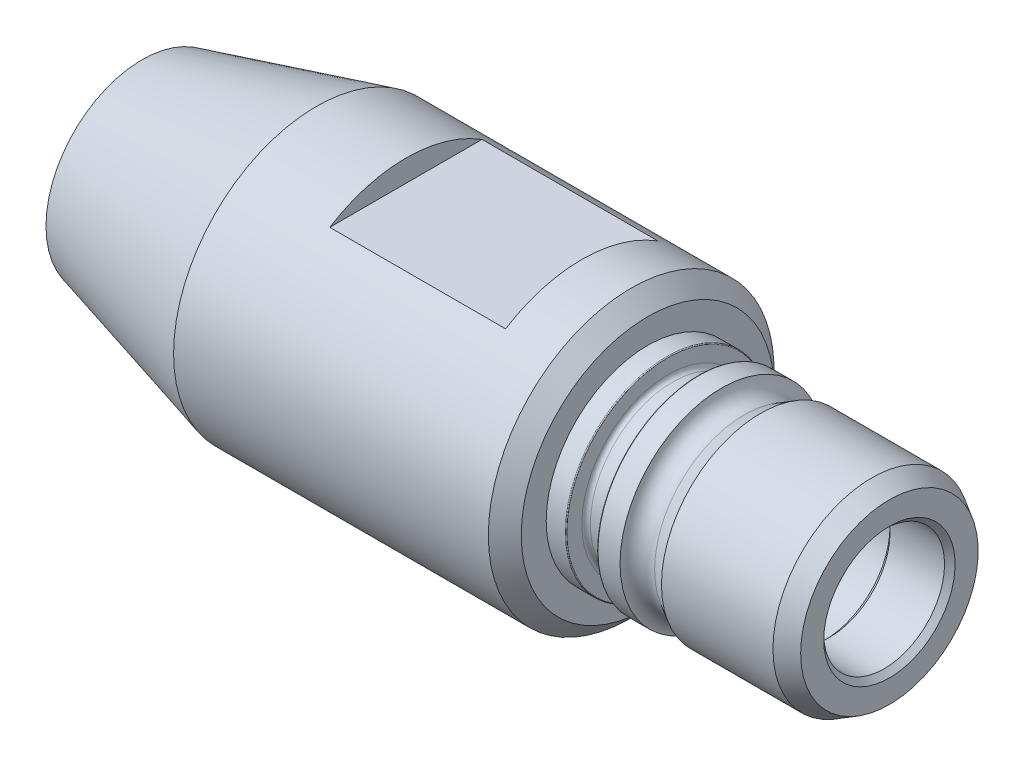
ISO-10303-21;
HEADER;
FILE_DESCRIPTION(('STEP AP214'),'2;1');
FILE_NAME('part.step','',(''),(''),'','','');
FILE_SCHEMA(('AUTOMOTIVE_DESIGN { 1 0 10303 214 1 1 1 1 }'));
ENDSEC;
DATA;
#1=APPLICATION_CONTEXT('core data for automotive mechanical design processes');
#2=APPLICATION_PROTOCOL_DEFINITION('international standard','automotive_design',2000,#1);
#3=PRODUCT_CONTEXT('',#1,'mechanical');
#4=PRODUCT('Part','Part','',(#3));
#5=PRODUCT_RELATED_PRODUCT_CATEGORY('part','',(#4));
#6=PRODUCT_DEFINITION_FORMATION('','',#4);
#7=PRODUCT_DEFINITION_CONTEXT('part definition',#1,'design');
#8=PRODUCT_DEFINITION('design','',#6,#7);
#9=PRODUCT_DEFINITION_SHAPE('','',#8);
#10=(LENGTH_UNIT() NAMED_UNIT(*) SI_UNIT(.MILLI.,.METRE.));
#11=(NAMED_UNIT(*) PLANE_ANGLE_UNIT() SI_UNIT($,.RADIAN.));
#12=(NAMED_UNIT(*) SI_UNIT($,.STERADIAN.) SOLID_ANGLE_UNIT());
#13=UNCERTAINTY_MEASURE_WITH_UNIT(LENGTH_MEASURE(1.E-05),#10,'distance_accuracy_value','');
#14=(GEOMETRIC_REPRESENTATION_CONTEXT(3) GLOBAL_UNCERTAINTY_ASSIGNED_CONTEXT((#13)) GLOBAL_UNIT_ASSIGNED_CONTEXT((#10,
#11,#12)) REPRESENTATION_CONTEXT('',''));
#15=CARTESIAN_POINT('',(0.,0.,0.));
#16=DIRECTION('',(0.,0.,1.));
#17=DIRECTION('',(1.,0.,0.));
#18=AXIS2_PLACEMENT_3D('',#15,#16,#17);
#19=CARTESIAN_POINT('',(0.,0.,0.));
#20=DIRECTION('',(1.,0.,0.));
#21=DIRECTION('',(0.,0.,-1.));
#22=AXIS2_PLACEMENT_3D('',#19,#20,#21);
#23=PLANE('',#22);
#24=CARTESIAN_POINT('',(0.,0.,0.));
#25=DIRECTION('',(-1.,0.,0.));
#26=DIRECTION('',(0.,0.,1.));
#27=AXIS2_PLACEMENT_3D('',#24,#25,#26);
#28=CIRCLE('',#27,13.890625);
#29=CARTESIAN_POINT('',(0.,0.,13.890625));
#30=VERTEX_POINT('',#29);
#31=EDGE_CURVE('E274',#30,#30,#28,.T.);
#32=ORIENTED_EDGE('',*,*,#31,.T.);
#33=EDGE_LOOP('',(#32));
#34=FACE_BOUND('',#33,.T.);
#35=CARTESIAN_POINT('',(0.,0.,0.));
#36=DIRECTION('',(-1.,0.,0.));
#37=DIRECTION('',(0.,0.,1.));
#38=AXIS2_PLACEMENT_3D('',#35,#36,#37);
#39=CIRCLE('',#38,8.7249);
#40=CARTESIAN_POINT('',(0.,0.,8.7249));
#41=VERTEX_POINT('',#40);
#42=EDGE_CURVE('E261',#41,#41,#39,.T.);
#43=ORIENTED_EDGE('',*,*,#42,.F.);
#44=EDGE_LOOP('',(#43));
#45=FACE_BOUND('',#44,.T.);
#46=ADVANCED_FACE('F35',(#34,#45),#23,.F.);
#47=CARTESIAN_POINT('',(0.,0.,0.));
#48=DIRECTION('',(-1.,0.,0.));
#49=DIRECTION('',(0.,0.,1.));
#50=AXIS2_PLACEMENT_3D('',#47,#48,#49);
#51=CYLINDRICAL_SURFACE('',#50,14.2875);
#52=CARTESIAN_POINT('',(89.3067904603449,0.,0.));
#53=DIRECTION('',(-1.,0.,0.));
#54=DIRECTION('',(0.,0.,1.));
#55=AXIS2_PLACEMENT_3D('',#52,#53,#54);
#56=CIRCLE('',#55,14.2875);
#57=CARTESIAN_POINT('',(89.3067904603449,0.,14.2875));
#58=VERTEX_POINT('',#57);
#59=EDGE_CURVE('E312',#58,#58,#56,.T.);
#60=ORIENTED_EDGE('',*,*,#59,.F.);
#61=EDGE_LOOP('',(#60));
#62=FACE_BOUND('',#61,.T.);
#63=CARTESIAN_POINT('',(105.41,0.,0.));
#64=DIRECTION('',(-1.,0.,0.));
#65=DIRECTION('',(0.,0.,1.));
#66=AXIS2_PLACEMENT_3D('',#63,#64,#65);
#67=CIRCLE('',#66,14.2875);
#68=CARTESIAN_POINT('',(105.41,0.,14.2875));
#69=VERTEX_POINT('',#68);
#70=EDGE_CURVE('E264',#69,#69,#67,.T.);
#71=ORIENTED_EDGE('',*,*,#70,.T.);
#72=EDGE_LOOP('',(#71));
#73=FACE_BOUND('',#72,.T.);
#74=ADVANCED_FACE('F111',(#62,#73),#51,.T.);
#75=CARTESIAN_POINT('',(73.025,14.6558,0.));
#76=DIRECTION('',(-1.,0.,0.));
#77=DIRECTION('',(0.,0.,1.));
#78=AXIS2_PLACEMENT_3D('',#75,#76,#77);
#79=PLANE('',#78);
#80=CARTESIAN_POINT('',(73.025,0.,0.));
#81=DIRECTION('',(-1.,0.,0.));
#82=DIRECTION('',(0.,0.,1.));
#83=AXIS2_PLACEMENT_3D('',#80,#81,#82);
#84=CIRCLE('',#83,14.6558);
#85=CARTESIAN_POINT('',(73.025,0.,14.6558));
#86=VERTEX_POINT('',#85);
#87=EDGE_CURVE('E279',#86,#86,#84,.T.);
#88=ORIENTED_EDGE('',*,*,#87,.T.);
#89=EDGE_LOOP('',(#88));
#90=FACE_BOUND('',#89,.T.);
#91=CARTESIAN_POINT('',(73.025,0.,0.));
#92=DIRECTION('',(-1.,0.,0.));
#93=DIRECTION('',(0.,0.,1.));
#94=AXIS2_PLACEMENT_3D('',#91,#92,#93);
#95=CIRCLE('',#94,18.25625);
#96=CARTESIAN_POINT('',(73.025,0.,18.25625));
#97=VERTEX_POINT('',#96);
#98=EDGE_CURVE('E270',#97,#97,#95,.T.);
#99=ORIENTED_EDGE('',*,*,#98,.F.);
#100=EDGE_LOOP('',(#99));
#101=FACE_BOUND('',#100,.T.);
#102=ADVANCED_FACE('F117',(#90,#101),#79,.F.);
#103=CARTESIAN_POINT('',(89.3067904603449,0.,0.));
#104=DIRECTION('',(1.,0.,0.));
#105=DIRECTION('',(0.,0.,-1.));
#106=AXIS2_PLACEMENT_3D('',#103,#104,#105);
#107=CONICAL_SURFACE('',#106,14.2875,0.523598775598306);
#108=CARTESIAN_POINT('',(86.96198,0.,0.));
#109=DIRECTION('',(-1.,0.,0.));
#110=DIRECTION('',(0.,0.,1.));
#111=AXIS2_PLACEMENT_3D('',#108,#109,#110);
#112=CIRCLE('',#111,12.9337230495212);
#113=CARTESIAN_POINT('',(86.96198,0.,12.9337230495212));
#114=VERTEX_POINT('',#113);
#115=EDGE_CURVE('E309',#114,#114,#112,.T.);
#116=ORIENTED_EDGE('',*,*,#115,.F.);
#117=EDGE_LOOP('',(#116));
#118=FACE_BOUND('',#117,.T.);
#119=ORIENTED_EDGE('',*,*,#59,.T.);
#120=EDGE_LOOP('',(#119));
#121=FACE_BOUND('',#120,.T.);
#122=ADVANCED_FACE('F136',(#118,#121),#107,.T.);
#123=CARTESIAN_POINT('',(85.9550265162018,0.,0.));
#124=DIRECTION('',(-1.,0.,0.));
#125=DIRECTION('',(0.,0.,1.));
#126=AXIS2_PLACEMENT_3D('',#123,#124,#125);
#127=TOROIDAL_SURFACE('',#126,14.986,2.286);
#128=CARTESIAN_POINT('',(83.693,0.,0.));
#129=DIRECTION('',(-1.,0.,0.));
#130=DIRECTION('',(0.,0.,1.));
#131=AXIS2_PLACEMENT_3D('',#128,#129,#130);
#132=CIRCLE('',#131,14.6558);
#133=CARTESIAN_POINT('',(83.693,0.,14.6558));
#134=VERTEX_POINT('',#133);
#135=EDGE_CURVE('E306',#134,#134,#132,.T.);
#136=ORIENTED_EDGE('',*,*,#135,.F.);
#137=EDGE_LOOP('',(#136));
#138=FACE_BOUND('',#137,.T.);
#139=ORIENTED_EDGE('',*,*,#115,.T.);
#140=EDGE_LOOP('',(#139));
#141=FACE_BOUND('',#140,.T.);
#142=ADVANCED_FACE('F173',(#138,#141),#127,.F.);
#143=CARTESIAN_POINT('',(0.,0.,0.));
#144=DIRECTION('',(-1.,0.,0.));
#145=DIRECTION('',(0.,0.,1.));
#146=AXIS2_PLACEMENT_3D('',#143,#144,#145);
#147=CYLINDRICAL_SURFACE('',#146,14.6558);
#148=CARTESIAN_POINT('',(80.5125760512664,0.,0.));
#149=DIRECTION('',(-1.,0.,0.));
#150=DIRECTION('',(0.,0.,1.));
#151=AXIS2_PLACEMENT_3D('',#148,#149,#150);
#152=CIRCLE('',#151,14.6558);
#153=CARTESIAN_POINT('',(80.5125760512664,0.,14.6558));
#154=VERTEX_POINT('',#153);
#155=EDGE_CURVE('E303',#154,#154,#152,.T.);
#156=ORIENTED_EDGE('',*,*,#155,.F.);
#157=EDGE_LOOP('',(#156));
#158=FACE_BOUND('',#157,.T.);
#159=ORIENTED_EDGE('',*,*,#135,.T.);
#160=EDGE_LOOP('',(#159));
#161=FACE_BOUND('',#160,.T.);
#162=ADVANCED_FACE('F169',(#158,#161),#147,.T.);
#163=CARTESIAN_POINT('',(80.5125760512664,0.,0.));
#164=DIRECTION('',(-1.,0.,0.));
#165=DIRECTION('',(0.,0.,1.));
#166=AXIS2_PLACEMENT_3D('',#163,#164,#165);
#167=TOROIDAL_SURFACE('',#166,14.5288,0.126999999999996);
#168=CARTESIAN_POINT('',(80.3856969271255,0.,0.));
#169=DIRECTION('',(-1.,0.,0.));
#170=DIRECTION('',(0.,0.,1.));
#171=AXIS2_PLACEMENT_3D('',#168,#169,#170);
#172=CIRCLE('',#171,14.5343396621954);
#173=CARTESIAN_POINT('',(80.3856969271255,0.,14.5343396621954));
#174=VERTEX_POINT('',#173);
#175=EDGE_CURVE('E300',#174,#174,#172,.T.);
#176=ORIENTED_EDGE('',*,*,#175,.F.);
#177=EDGE_LOOP('',(#176));
#178=FACE_BOUND('',#177,.T.);
#179=ORIENTED_EDGE('',*,*,#155,.T.);
#180=EDGE_LOOP('',(#179));
#181=FACE_BOUND('',#180,.T.);
#182=ADVANCED_FACE('F165',(#178,#181),#167,.T.);
#183=CARTESIAN_POINT('',(80.3856969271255,0.,0.));
#184=DIRECTION('',(1.,0.,0.));
#185=DIRECTION('',(0.,0.,-1.));
#186=AXIS2_PLACEMENT_3D('',#183,#184,#185);
#187=CONICAL_SURFACE('',#186,14.5343396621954,1.52716309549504);
#188=CARTESIAN_POINT('',(80.2966356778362,0.,0.));
#189=DIRECTION('',(-1.,0.,0.));
#190=DIRECTION('',(0.,0.,1.));
#191=AXIS2_PLACEMENT_3D('',#188,#189,#190);
#192=CIRCLE('',#191,12.494501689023);
#193=CARTESIAN_POINT('',(80.2966356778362,0.,12.494501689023));
#194=VERTEX_POINT('',#193);
#195=EDGE_CURVE('E297',#194,#194,#192,.T.);
#196=ORIENTED_EDGE('',*,*,#195,.F.);
#197=EDGE_LOOP('',(#196));
#198=FACE_BOUND('',#197,.T.);
#199=ORIENTED_EDGE('',*,*,#175,.T.);
#200=EDGE_LOOP('',(#199));
#201=FACE_BOUND('',#200,.T.);
#202=ADVANCED_FACE('F161',(#198,#201),#187,.T.);
#203=CARTESIAN_POINT('',(79.6622400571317,0.,0.));
#204=DIRECTION('',(-1.,0.,0.));
#205=DIRECTION('',(0.,0.,1.));
#206=AXIS2_PLACEMENT_3D('',#203,#204,#205);
#207=TOROIDAL_SURFACE('',#206,12.5222,0.635000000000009);
#208=CARTESIAN_POINT('',(79.6622400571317,0.,0.));
#209=DIRECTION('',(-1.,0.,0.));
#210=DIRECTION('',(0.,0.,1.));
#211=AXIS2_PLACEMENT_3D('',#208,#209,#210);
#212=CIRCLE('',#211,11.8872);
#213=CARTESIAN_POINT('',(79.6622400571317,0.,11.8872));
#214=VERTEX_POINT('',#213);
#215=EDGE_CURVE('E294',#214,#214,#212,.T.);
#216=ORIENTED_EDGE('',*,*,#215,.F.);
#217=EDGE_LOOP('',(#216));
#218=FACE_BOUND('',#217,.T.);
#219=ORIENTED_EDGE('',*,*,#195,.T.);
#220=EDGE_LOOP('',(#219));
#221=FACE_BOUND('',#220,.T.);
#222=ADVANCED_FACE('F157',(#218,#221),#207,.F.);
#223=CARTESIAN_POINT('',(0.,0.,0.));
#224=DIRECTION('',(-1.,0.,0.));
#225=DIRECTION('',(0.,0.,1.));
#226=AXIS2_PLACEMENT_3D('',#223,#224,#225);
#227=CYLINDRICAL_SURFACE('',#226,11.8872);
#228=CARTESIAN_POINT('',(76.6362005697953,0.,0.));
#229=DIRECTION('',(-1.,0.,0.));
#230=DIRECTION('',(0.,0.,1.));
#231=AXIS2_PLACEMENT_3D('',#228,#229,#230);
#232=CIRCLE('',#231,11.8872);
#233=CARTESIAN_POINT('',(76.6362005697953,0.,11.8872));
#234=VERTEX_POINT('',#233);
#235=EDGE_CURVE('E291',#234,#234,#232,.T.);
#236=ORIENTED_EDGE('',*,*,#235,.F.);
#237=EDGE_LOOP('',(#236));
#238=FACE_BOUND('',#237,.T.);
#239=ORIENTED_EDGE('',*,*,#215,.T.);
#240=EDGE_LOOP('',(#239));
#241=FACE_BOUND('',#240,.T.);
#242=ADVANCED_FACE('F153',(#238,#241),#227,.T.);
#243=CARTESIAN_POINT('',(76.6362005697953,0.,0.));
#244=DIRECTION('',(-1.,0.,0.));
#245=DIRECTION('',(0.,0.,1.));
#246=AXIS2_PLACEMENT_3D('',#243,#244,#245);
#247=TOROIDAL_SURFACE('',#246,12.5222,0.635000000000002);
#248=CARTESIAN_POINT('',(76.0018049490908,0.,0.));
#249=DIRECTION('',(-1.,0.,0.));
#250=DIRECTION('',(0.,0.,1.));
#251=AXIS2_PLACEMENT_3D('',#248,#249,#250);
#252=CIRCLE('',#251,12.494501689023);
#253=CARTESIAN_POINT('',(76.0018049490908,0.,12.494501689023));
#254=VERTEX_POINT('',#253);
#255=EDGE_CURVE('E288',#254,#254,#252,.T.);
#256=ORIENTED_EDGE('',*,*,#255,.F.);
#257=EDGE_LOOP('',(#256));
#258=FACE_BOUND('',#257,.T.);
#259=ORIENTED_EDGE('',*,*,#235,.T.);
#260=EDGE_LOOP('',(#259));
#261=FACE_BOUND('',#260,.T.);
#262=ADVANCED_FACE('F149',(#258,#261),#247,.F.);
#263=CARTESIAN_POINT('',(76.0018049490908,0.,0.));
#264=DIRECTION('',(-1.,0.,0.));
#265=DIRECTION('',(0.,0.,1.));
#266=AXIS2_PLACEMENT_3D('',#263,#264,#265);
#267=CONICAL_SURFACE('',#266,12.494501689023,1.52716309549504);
#268=CARTESIAN_POINT('',(75.9127436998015,0.,0.));
#269=DIRECTION('',(-1.,0.,0.));
#270=DIRECTION('',(0.,0.,1.));
#271=AXIS2_PLACEMENT_3D('',#268,#269,#270);
#272=CIRCLE('',#271,14.5343396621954);
#273=CARTESIAN_POINT('',(75.9127436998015,0.,14.5343396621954));
#274=VERTEX_POINT('',#273);
#275=EDGE_CURVE('E285',#274,#274,#272,.T.);
#276=ORIENTED_EDGE('',*,*,#275,.F.);
#277=EDGE_LOOP('',(#276));
#278=FACE_BOUND('',#277,.T.);
#279=ORIENTED_EDGE('',*,*,#255,.T.);
#280=EDGE_LOOP('',(#279));
#281=FACE_BOUND('',#280,.T.);
#282=ADVANCED_FACE('F145',(#278,#281),#267,.T.);
#283=CARTESIAN_POINT('',(75.7858645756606,0.,0.));
#284=DIRECTION('',(-1.,0.,0.));
#285=DIRECTION('',(0.,0.,1.));
#286=AXIS2_PLACEMENT_3D('',#283,#284,#285);
#287=TOROIDAL_SURFACE('',#286,14.5288,0.127000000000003);
#288=CARTESIAN_POINT('',(75.7858645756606,0.,0.));
#289=DIRECTION('',(-1.,0.,0.));
#290=DIRECTION('',(0.,0.,1.));
#291=AXIS2_PLACEMENT_3D('',#288,#289,#290);
#292=CIRCLE('',#291,14.6558);
#293=CARTESIAN_POINT('',(75.7858645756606,0.,14.6558));
#294=VERTEX_POINT('',#293);
#295=EDGE_CURVE('E282',#294,#294,#292,.T.);
#296=ORIENTED_EDGE('',*,*,#295,.F.);
#297=EDGE_LOOP('',(#296));
#298=FACE_BOUND('',#297,.T.);
#299=ORIENTED_EDGE('',*,*,#275,.T.);
#300=EDGE_LOOP('',(#299));
#301=FACE_BOUND('',#300,.T.);
#302=ADVANCED_FACE('F141',(#298,#301),#287,.T.);
#303=CARTESIAN_POINT('',(0.,0.,0.));
#304=DIRECTION('',(-1.,0.,0.));
#305=DIRECTION('',(0.,0.,1.));
#306=AXIS2_PLACEMENT_3D('',#303,#304,#305);
#307=CYLINDRICAL_SURFACE('',#306,14.6558);
#308=ORIENTED_EDGE('',*,*,#87,.F.);
#309=EDGE_LOOP('',(#308));
#310=FACE_BOUND('',#309,.T.);
#311=ORIENTED_EDGE('',*,*,#295,.T.);
#312=EDGE_LOOP('',(#311));
#313=FACE_BOUND('',#312,.T.);
#314=ADVANCED_FACE('F138',(#310,#313),#307,.T.);
#315=CARTESIAN_POINT('',(69.0358945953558,0.,0.));
#316=DIRECTION('',(-1.,0.,0.));
#317=DIRECTION('',(0.,0.,1.));
#318=AXIS2_PLACEMENT_3D('',#315,#316,#317);
#319=CONICAL_SURFACE('',#318,22.2453554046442,0.785398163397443);
#320=ORIENTED_EDGE('',*,*,#98,.T.);
#321=EDGE_LOOP('',(#320));
#322=FACE_BOUND('',#321,.T.);
#323=CARTESIAN_POINT('',(70.64375,0.,0.));
#324=DIRECTION('',(-1.,0.,0.));
#325=DIRECTION('',(0.,0.,1.));
#326=AXIS2_PLACEMENT_3D('',#323,#324,#325);
#327=CIRCLE('',#326,20.6375);
#328=CARTESIAN_POINT('',(70.64375,0.,20.6375));
#329=VERTEX_POINT('',#328);
#330=EDGE_CURVE('E273',#329,#329,#327,.F.);
#331=ORIENTED_EDGE('',*,*,#330,.T.);
#332=EDGE_LOOP('',(#331));
#333=FACE_BOUND('',#332,.T.);
#334=ADVANCED_FACE('F129',(#322,#333),#319,.T.);
#335=CARTESIAN_POINT('',(25.1796802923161,0.,0.));
#336=DIRECTION('',(1.,0.,0.));
#337=DIRECTION('',(0.,0.,-1.));
#338=AXIS2_PLACEMENT_3D('',#335,#336,#337);
#339=CONICAL_SURFACE('',#338,20.6375,0.261799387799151);
#340=ORIENTED_EDGE('',*,*,#31,.F.);
#341=EDGE_LOOP('',(#340));
#342=FACE_BOUND('',#341,.T.);
#343=CARTESIAN_POINT('',(25.1796802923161,0.,0.));
#344=DIRECTION('',(-1.,0.,0.));
#345=DIRECTION('',(0.,0.,1.));
#346=AXIS2_PLACEMENT_3D('',#343,#344,#345);
#347=CIRCLE('',#346,20.6375);
#348=CARTESIAN_POINT('',(25.1796802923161,0.,20.6375));
#349=VERTEX_POINT('',#348);
#350=EDGE_CURVE('E276',#349,#349,#347,.T.);
#351=ORIENTED_EDGE('',*,*,#350,.T.);
#352=EDGE_LOOP('',(#351));
#353=FACE_BOUND('',#352,.T.);
#354=ADVANCED_FACE('F126',(#342,#353),#339,.T.);
#355=CARTESIAN_POINT('',(0.,0.,0.));
#356=DIRECTION('',(-1.,0.,0.));
#357=DIRECTION('',(0.,0.,1.));
#358=AXIS2_PLACEMENT_3D('',#355,#356,#357);
#359=CYLINDRICAL_SURFACE('',#358,20.6375);
#360=DIRECTION('',(-1.,0.,0.));
#361=VECTOR('',#360,1.);
#362=CARTESIAN_POINT('',(0.,-17.4625,-10.9985226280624));
#363=LINE('',#362,#361);
#364=CARTESIAN_POINT('',(63.5,-17.4625,-10.9985226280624));
#365=VERTEX_POINT('',#364);
#366=CARTESIAN_POINT('',(38.1,-17.4625,-10.9985226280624));
#367=VERTEX_POINT('',#366);
#368=EDGE_CURVE('E86',#365,#367,#363,.T.);
#369=ORIENTED_EDGE('',*,*,#368,.T.);
#370=CARTESIAN_POINT('',(38.1,0.,0.));
#371=DIRECTION('',(-1.,0.,0.));
#372=DIRECTION('',(0.,0.,1.));
#373=AXIS2_PLACEMENT_3D('',#370,#371,#372);
#374=CIRCLE('',#373,20.6375);
#375=CARTESIAN_POINT('',(38.1,-17.4625,10.9985226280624));
#376=VERTEX_POINT('',#375);
#377=EDGE_CURVE('E92',#367,#376,#374,.T.);
#378=ORIENTED_EDGE('',*,*,#377,.T.);
#379=DIRECTION('',(-1.,0.,0.));
#380=VECTOR('',#379,1.);
#381=CARTESIAN_POINT('',(0.,-17.4625,10.9985226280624));
#382=LINE('',#381,#380);
#383=CARTESIAN_POINT('',(63.5,-17.4625,10.9985226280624));
#384=VERTEX_POINT('',#383);
#385=EDGE_CURVE('E79',#376,#384,#382,.F.);
#386=ORIENTED_EDGE('',*,*,#385,.T.);
#387=CARTESIAN_POINT('',(63.5,0.,0.));
#388=DIRECTION('',(1.,0.,0.));
#389=DIRECTION('',(0.,0.,-1.));
#390=AXIS2_PLACEMENT_3D('',#387,#388,#389);
#391=CIRCLE('',#390,20.6375);
#392=EDGE_CURVE('E74',#384,#365,#391,.T.);
#393=ORIENTED_EDGE('',*,*,#392,.T.);
#394=EDGE_LOOP('',(#369,#378,#386,#393));
#395=FACE_BOUND('',#394,.T.);
#396=CARTESIAN_POINT('',(63.5,0.,0.));
#397=DIRECTION('',(1.,0.,0.));
#398=DIRECTION('',(0.,0.,-1.));
#399=AXIS2_PLACEMENT_3D('',#396,#397,#398);
#400=CIRCLE('',#399,20.6375);
#401=CARTESIAN_POINT('',(63.5,17.4625,-10.9985226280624));
#402=VERTEX_POINT('',#401);
#403=CARTESIAN_POINT('',(63.5,17.4625,10.9985226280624));
#404=VERTEX_POINT('',#403);
#405=EDGE_CURVE('E218',#402,#404,#400,.T.);
#406=ORIENTED_EDGE('',*,*,#405,.T.);
#407=DIRECTION('',(-1.,0.,0.));
#408=VECTOR('',#407,1.);
#409=CARTESIAN_POINT('',(0.,17.4625,10.9985226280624));
#410=LINE('',#409,#408);
#411=CARTESIAN_POINT('',(38.1,17.4625,10.9985226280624));
#412=VERTEX_POINT('',#411);
#413=EDGE_CURVE('E80',#404,#412,#410,.T.);
#414=ORIENTED_EDGE('',*,*,#413,.T.);
#415=CARTESIAN_POINT('',(38.1,0.,0.));
#416=DIRECTION('',(-1.,0.,0.));
#417=DIRECTION('',(0.,0.,1.));
#418=AXIS2_PLACEMENT_3D('',#415,#416,#417);
#419=CIRCLE('',#418,20.6375);
#420=CARTESIAN_POINT('',(38.1,17.4625,-10.9985226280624));
#421=VERTEX_POINT('',#420);
#422=EDGE_CURVE('E221',#412,#421,#419,.T.);
#423=ORIENTED_EDGE('',*,*,#422,.T.);
#424=DIRECTION('',(-1.,0.,0.));
#425=VECTOR('',#424,1.);
#426=CARTESIAN_POINT('',(0.,17.4625,-10.9985226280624));
#427=LINE('',#426,#425);
#428=EDGE_CURVE('E209',#421,#402,#427,.F.);
#429=ORIENTED_EDGE('',*,*,#428,.T.);
#430=EDGE_LOOP('',(#406,#414,#423,#429));
#431=FACE_BOUND('',#430,.T.);
#432=ORIENTED_EDGE('',*,*,#350,.F.);
#433=EDGE_LOOP('',(#432));
#434=FACE_BOUND('',#433,.T.);
#435=ORIENTED_EDGE('',*,*,#330,.F.);
#436=EDGE_LOOP('',(#435));
#437=FACE_BOUND('',#436,.T.);
#438=ADVANCED_FACE('F90',(#395,#431,#434,#437),#359,.T.);
#439=CARTESIAN_POINT('',(105.41,0.,0.));
#440=DIRECTION('',(-1.,0.,0.));
#441=DIRECTION('',(0.,0.,1.));
#442=AXIS2_PLACEMENT_3D('',#439,#440,#441);
#443=CONICAL_SURFACE('',#442,14.2875,0.523598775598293);
#444=CARTESIAN_POINT('',(107.95,0.,0.));
#445=DIRECTION('',(-1.,0.,0.));
#446=DIRECTION('',(0.,0.,1.));
#447=AXIS2_PLACEMENT_3D('',#444,#445,#446);
#448=CIRCLE('',#447,12.8210303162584);
#449=CARTESIAN_POINT('',(107.95,0.,12.8210303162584));
#450=VERTEX_POINT('',#449);
#451=EDGE_CURVE('E267',#450,#450,#448,.T.);
#452=ORIENTED_EDGE('',*,*,#451,.T.);
#453=EDGE_LOOP('',(#452));
#454=FACE_BOUND('',#453,.T.);
#455=ORIENTED_EDGE('',*,*,#70,.F.);
#456=EDGE_LOOP('',(#455));
#457=FACE_BOUND('',#456,.T.);
#458=ADVANCED_FACE('F133',(#454,#457),#443,.T.);
#459=CARTESIAN_POINT('',(107.95,14.2875,0.));
#460=DIRECTION('',(-1.,0.,0.));
#461=DIRECTION('',(0.,0.,1.));
#462=AXIS2_PLACEMENT_3D('',#459,#460,#461);
#463=PLANE('',#462);
#464=CARTESIAN_POINT('',(107.95,0.,0.));
#465=DIRECTION('',(-1.,0.,0.));
#466=DIRECTION('',(0.,0.,1.));
#467=AXIS2_PLACEMENT_3D('',#464,#465,#466);
#468=CIRCLE('',#467,9.48690000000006);
#469=CARTESIAN_POINT('',(107.95,0.,9.48690000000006));
#470=VERTEX_POINT('',#469);
#471=EDGE_CURVE('E320',#470,#470,#468,.T.);
#472=ORIENTED_EDGE('',*,*,#471,.T.);
#473=EDGE_LOOP('',(#472));
#474=FACE_BOUND('',#473,.T.);
#475=ORIENTED_EDGE('',*,*,#451,.F.);
#476=EDGE_LOOP('',(#475));
#477=FACE_BOUND('',#476,.T.);
#478=ADVANCED_FACE('F124',(#474,#477),#463,.F.);
#479=CARTESIAN_POINT('',(0.,0.,0.));
#480=DIRECTION('',(-1.,0.,0.));
#481=DIRECTION('',(0.,0.,1.));
#482=AXIS2_PLACEMENT_3D('',#479,#480,#481);
#483=CYLINDRICAL_SURFACE('',#482,8.7249);
#484=CARTESIAN_POINT('',(30.9372,0.,0.));
#485=DIRECTION('',(-1.,0.,0.));
#486=DIRECTION('',(0.,0.,1.));
#487=AXIS2_PLACEMENT_3D('',#484,#485,#486);
#488=CIRCLE('',#487,8.7249);
#489=CARTESIAN_POINT('',(30.9372,0.,8.7249));
#490=VERTEX_POINT('',#489);
#491=EDGE_CURVE('E258',#490,#490,#488,.T.);
#492=ORIENTED_EDGE('',*,*,#491,.F.);
#493=EDGE_LOOP('',(#492));
#494=FACE_BOUND('',#493,.T.);
#495=ORIENTED_EDGE('',*,*,#42,.T.);
#496=EDGE_LOOP('',(#495));
#497=FACE_BOUND('',#496,.T.);
#498=ADVANCED_FACE('F351',(#494,#497),#483,.F.);
#499=CARTESIAN_POINT('',(30.9372,7.1374,0.));
#500=DIRECTION('',(-1.,0.,0.));
#501=DIRECTION('',(0.,0.,1.));
#502=AXIS2_PLACEMENT_3D('',#499,#500,#501);
#503=PLANE('',#502);
#504=CARTESIAN_POINT('',(30.9372,0.,0.));
#505=DIRECTION('',(-1.,0.,0.));
#506=DIRECTION('',(0.,0.,1.));
#507=AXIS2_PLACEMENT_3D('',#504,#505,#506);
#508=CIRCLE('',#507,7.41474531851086);
#509=CARTESIAN_POINT('',(30.9372,0.,7.41474531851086));
#510=VERTEX_POINT('',#509);
#511=EDGE_CURVE('E202',#510,#510,#508,.F.);
#512=ORIENTED_EDGE('',*,*,#511,.T.);
#513=EDGE_LOOP('',(#512));
#514=FACE_BOUND('',#513,.T.);
#515=ORIENTED_EDGE('',*,*,#491,.T.);
#516=EDGE_LOOP('',(#515));
#517=FACE_BOUND('',#516,.T.);
#518=ADVANCED_FACE('F347',(#514,#517),#503,.T.);
#519=CARTESIAN_POINT('',(0.,0.,0.));
#520=DIRECTION('',(-1.,0.,0.));
#521=DIRECTION('',(0.,0.,1.));
#522=AXIS2_PLACEMENT_3D('',#519,#520,#521);
#523=CYLINDRICAL_SURFACE('',#522,7.1374);
#524=CARTESIAN_POINT('',(33.4772,0.,0.));
#525=DIRECTION('',(-1.,0.,0.));
#526=DIRECTION('',(0.,0.,1.));
#527=AXIS2_PLACEMENT_3D('',#524,#525,#526);
#528=CIRCLE('',#527,7.1374);
#529=CARTESIAN_POINT('',(33.4772,0.,7.1374));
#530=VERTEX_POINT('',#529);
#531=EDGE_CURVE('E11',#530,#530,#528,.F.);
#532=ORIENTED_EDGE('',*,*,#531,.T.);
#533=EDGE_LOOP('',(#532));
#534=FACE_BOUND('',#533,.T.);
#535=CARTESIAN_POINT('',(31.6992,0.,0.));
#536=DIRECTION('',(-1.,0.,0.));
#537=DIRECTION('',(0.,0.,1.));
#538=AXIS2_PLACEMENT_3D('',#535,#536,#537);
#539=CIRCLE('',#538,7.1374);
#540=CARTESIAN_POINT('',(31.6992,0.,7.1374));
#541=VERTEX_POINT('',#540);
#542=EDGE_CURVE('E205',#541,#541,#539,.T.);
#543=ORIENTED_EDGE('',*,*,#542,.T.);
#544=EDGE_LOOP('',(#543));
#545=FACE_BOUND('',#544,.T.);
#546=ADVANCED_FACE('F340',(#534,#545),#523,.F.);
#547=CARTESIAN_POINT('',(34.1122,7.1374,0.));
#548=DIRECTION('',(-1.,0.,0.));
#549=DIRECTION('',(0.,0.,1.));
#550=AXIS2_PLACEMENT_3D('',#547,#548,#549);
#551=PLANE('',#550);
#552=CARTESIAN_POINT('',(34.1122,0.,0.));
#553=DIRECTION('',(-1.,0.,0.));
#554=DIRECTION('',(0.,0.,1.));
#555=AXIS2_PLACEMENT_3D('',#552,#553,#554);
#556=CIRCLE('',#555,6.5024);
#557=CARTESIAN_POINT('',(34.1122,0.,6.5024));
#558=VERTEX_POINT('',#557);
#559=EDGE_CURVE('E43',#558,#558,#556,.T.);
#560=ORIENTED_EDGE('',*,*,#559,.T.);
#561=EDGE_LOOP('',(#560));
#562=FACE_BOUND('',#561,.T.);
#563=CARTESIAN_POINT('',(34.1122,0.,0.));
#564=DIRECTION('',(1.,0.,0.));
#565=DIRECTION('',(0.,0.,-1.));
#566=AXIS2_PLACEMENT_3D('',#563,#564,#565);
#567=CIRCLE('',#566,4.35609999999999);
#568=CARTESIAN_POINT('',(34.1122,0.,-4.35609999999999));
#569=VERTEX_POINT('',#568);
#570=EDGE_CURVE('E246',#569,#569,#567,.T.);
#571=ORIENTED_EDGE('',*,*,#570,.T.);
#572=EDGE_LOOP('',(#571));
#573=FACE_BOUND('',#572,.T.);
#574=ADVANCED_FACE('F100',(#562,#573),#551,.T.);
#575=CARTESIAN_POINT('',(107.95,0.,0.));
#576=DIRECTION('',(1.,0.,0.));
#577=DIRECTION('',(0.,0.,-1.));
#578=AXIS2_PLACEMENT_3D('',#575,#576,#577);
#579=CYLINDRICAL_SURFACE('',#578,8.7249);
#580=CARTESIAN_POINT('',(99.314,0.,0.));
#581=DIRECTION('',(1.,0.,0.));
#582=DIRECTION('',(0.,0.,-1.));
#583=AXIS2_PLACEMENT_3D('',#580,#581,#582);
#584=CIRCLE('',#583,8.7249);
#585=CARTESIAN_POINT('',(99.314,0.,-8.7249));
#586=VERTEX_POINT('',#585);
#587=EDGE_CURVE('E212',#586,#586,#584,.F.);
#588=ORIENTED_EDGE('',*,*,#587,.T.);
#589=EDGE_LOOP('',(#588));
#590=FACE_BOUND('',#589,.T.);
#591=CARTESIAN_POINT('',(107.188,0.,0.));
#592=DIRECTION('',(-1.,0.,0.));
#593=DIRECTION('',(0.,0.,1.));
#594=AXIS2_PLACEMENT_3D('',#591,#592,#593);
#595=CIRCLE('',#594,8.7249);
#596=CARTESIAN_POINT('',(107.188,0.,8.7249));
#597=VERTEX_POINT('',#596);
#598=EDGE_CURVE('E315',#597,#597,#595,.F.);
#599=ORIENTED_EDGE('',*,*,#598,.T.);
#600=EDGE_LOOP('',(#599));
#601=FACE_BOUND('',#600,.T.);
#602=ADVANCED_FACE('F325',(#590,#601),#579,.F.);
#603=CARTESIAN_POINT('',(98.552,9.652,0.));
#604=DIRECTION('',(1.,0.,0.));
#605=DIRECTION('',(0.,0.,-1.));
#606=AXIS2_PLACEMENT_3D('',#603,#604,#605);
#607=PLANE('',#606);
#608=CARTESIAN_POINT('',(98.552,0.,0.));
#609=DIRECTION('',(1.,0.,0.));
#610=DIRECTION('',(0.,0.,-1.));
#611=AXIS2_PLACEMENT_3D('',#608,#609,#610);
#612=CIRCLE('',#611,9.48689999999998);
#613=CARTESIAN_POINT('',(98.552,0.,-9.48689999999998));
#614=VERTEX_POINT('',#613);
#615=EDGE_CURVE('E207',#614,#614,#612,.T.);
#616=ORIENTED_EDGE('',*,*,#615,.T.);
#617=EDGE_LOOP('',(#616));
#618=FACE_BOUND('',#617,.T.);
#619=CARTESIAN_POINT('',(98.552,0.,0.));
#620=DIRECTION('',(1.,0.,0.));
#621=DIRECTION('',(0.,0.,-1.));
#622=AXIS2_PLACEMENT_3D('',#619,#620,#621);
#623=CIRCLE('',#622,9.652);
#624=CARTESIAN_POINT('',(98.552,0.,-9.652));
#625=VERTEX_POINT('',#624);
#626=EDGE_CURVE('E243',#625,#625,#623,.T.);
#627=ORIENTED_EDGE('',*,*,#626,.F.);
#628=EDGE_LOOP('',(#627));
#629=FACE_BOUND('',#628,.T.);
#630=ADVANCED_FACE('F329',(#618,#629),#607,.F.);
#631=CARTESIAN_POINT('',(93.726,0.,0.));
#632=DIRECTION('',(1.,0.,0.));
#633=DIRECTION('',(0.,0.,-1.));
#634=AXIS2_PLACEMENT_3D('',#631,#632,#633);
#635=CONICAL_SURFACE('',#634,6.33729999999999,0.785398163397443);
#636=CARTESIAN_POINT('',(92.964,0.,0.));
#637=DIRECTION('',(1.,0.,0.));
#638=DIRECTION('',(0.,0.,-1.));
#639=AXIS2_PLACEMENT_3D('',#636,#637,#638);
#640=CIRCLE('',#639,5.5753);
#641=CARTESIAN_POINT('',(92.964,0.,-5.5753));
#642=VERTEX_POINT('',#641);
#643=EDGE_CURVE('E255',#642,#642,#640,.T.);
#644=ORIENTED_EDGE('',*,*,#643,.F.);
#645=EDGE_LOOP('',(#644));
#646=FACE_BOUND('',#645,.T.);
#647=CARTESIAN_POINT('',(93.726,0.,0.));
#648=DIRECTION('',(1.,0.,0.));
#649=DIRECTION('',(0.,0.,-1.));
#650=AXIS2_PLACEMENT_3D('',#647,#648,#649);
#651=CIRCLE('',#650,6.33729999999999);
#652=CARTESIAN_POINT('',(93.726,0.,-6.33729999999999));
#653=VERTEX_POINT('',#652);
#654=EDGE_CURVE('E230',#653,#653,#651,.T.);
#655=ORIENTED_EDGE('',*,*,#654,.T.);
#656=EDGE_LOOP('',(#655));
#657=FACE_BOUND('',#656,.T.);
#658=ADVANCED_FACE('F337',(#646,#657),#635,.F.);
#659=CARTESIAN_POINT('',(107.95,0.,0.));
#660=DIRECTION('',(1.,0.,0.));
#661=DIRECTION('',(0.,0.,-1.));
#662=AXIS2_PLACEMENT_3D('',#659,#660,#661);
#663=CYLINDRICAL_SURFACE('',#662,5.5753);
#664=CARTESIAN_POINT('',(68.326,0.,0.));
#665=DIRECTION('',(1.,0.,0.));
#666=DIRECTION('',(0.,0.,-1.));
#667=AXIS2_PLACEMENT_3D('',#664,#665,#666);
#668=CIRCLE('',#667,5.5753);
#669=CARTESIAN_POINT('',(68.326,0.,-5.5753));
#670=VERTEX_POINT('',#669);
#671=EDGE_CURVE('E252',#670,#670,#668,.T.);
#672=ORIENTED_EDGE('',*,*,#671,.F.);
#673=EDGE_LOOP('',(#672));
#674=FACE_BOUND('',#673,.T.);
#675=ORIENTED_EDGE('',*,*,#643,.T.);
#676=EDGE_LOOP('',(#675));
#677=FACE_BOUND('',#676,.T.);
#678=ADVANCED_FACE('F513',(#674,#677),#663,.F.);
#679=CARTESIAN_POINT('',(68.326,5.5753,0.));
#680=DIRECTION('',(-1.,0.,0.));
#681=DIRECTION('',(0.,0.,1.));
#682=AXIS2_PLACEMENT_3D('',#679,#680,#681);
#683=PLANE('',#682);
#684=CARTESIAN_POINT('',(68.326,0.,0.));
#685=DIRECTION('',(1.,0.,0.));
#686=DIRECTION('',(0.,0.,-1.));
#687=AXIS2_PLACEMENT_3D('',#684,#685,#686);
#688=CIRCLE('',#687,4.35609999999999);
#689=CARTESIAN_POINT('',(68.326,0.,-4.35609999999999));
#690=VERTEX_POINT('',#689);
#691=EDGE_CURVE('E249',#690,#690,#688,.T.);
#692=ORIENTED_EDGE('',*,*,#691,.F.);
#693=EDGE_LOOP('',(#692));
#694=FACE_BOUND('',#693,.T.);
#695=ORIENTED_EDGE('',*,*,#671,.T.);
#696=EDGE_LOOP('',(#695));
#697=FACE_BOUND('',#696,.T.);
#698=ADVANCED_FACE('F504',(#694,#697),#683,.F.);
#699=CARTESIAN_POINT('',(107.95,0.,0.));
#700=DIRECTION('',(1.,0.,0.));
#701=DIRECTION('',(0.,0.,-1.));
#702=AXIS2_PLACEMENT_3D('',#699,#700,#701);
#703=CYLINDRICAL_SURFACE('',#702,4.35609999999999);
#704=ORIENTED_EDGE('',*,*,#570,.F.);
#705=EDGE_LOOP('',(#704));
#706=FACE_BOUND('',#705,.T.);
#707=ORIENTED_EDGE('',*,*,#691,.T.);
#708=EDGE_LOOP('',(#707));
#709=FACE_BOUND('',#708,.T.);
#710=ADVANCED_FACE('F495',(#706,#709),#703,.F.);
#711=CARTESIAN_POINT('',(107.95,0.,0.));
#712=DIRECTION('',(1.,0.,0.));
#713=DIRECTION('',(0.,0.,-1.));
#714=AXIS2_PLACEMENT_3D('',#711,#712,#713);
#715=CYLINDRICAL_SURFACE('',#714,9.652);
#716=CARTESIAN_POINT('',(94.488,0.,0.));
#717=DIRECTION('',(1.,0.,0.));
#718=DIRECTION('',(0.,0.,-1.));
#719=AXIS2_PLACEMENT_3D('',#716,#717,#718);
#720=CIRCLE('',#719,9.652);
#721=CARTESIAN_POINT('',(94.488,0.,-9.652));
#722=VERTEX_POINT('',#721);
#723=EDGE_CURVE('E240',#722,#722,#720,.T.);
#724=ORIENTED_EDGE('',*,*,#723,.F.);
#725=EDGE_LOOP('',(#724));
#726=FACE_BOUND('',#725,.T.);
#727=ORIENTED_EDGE('',*,*,#626,.T.);
#728=EDGE_LOOP('',(#727));
#729=FACE_BOUND('',#728,.T.);
#730=ADVANCED_FACE('F486',(#726,#729),#715,.F.);
#731=CARTESIAN_POINT('',(94.488,0.,0.));
#732=DIRECTION('',(1.,0.,0.));
#733=DIRECTION('',(0.,0.,-1.));
#734=AXIS2_PLACEMENT_3D('',#731,#732,#733);
#735=TOROIDAL_SURFACE('',#734,8.89,0.762);
#736=CARTESIAN_POINT('',(93.726,0.,0.));
#737=DIRECTION('',(1.,0.,0.));
#738=DIRECTION('',(0.,0.,-1.));
#739=AXIS2_PLACEMENT_3D('',#736,#737,#738);
#740=CIRCLE('',#739,8.88999999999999);
#741=CARTESIAN_POINT('',(93.726,0.,-8.88999999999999));
#742=VERTEX_POINT('',#741);
#743=EDGE_CURVE('E233',#742,#742,#740,.T.);
#744=ORIENTED_EDGE('',*,*,#743,.F.);
#745=EDGE_LOOP('',(#744));
#746=FACE_BOUND('',#745,.T.);
#747=ORIENTED_EDGE('',*,*,#723,.T.);
#748=EDGE_LOOP('',(#747));
#749=FACE_BOUND('',#748,.T.);
#750=ADVANCED_FACE('F477',(#746,#749),#735,.F.);
#751=CARTESIAN_POINT('',(93.726,6.33729999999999,0.));
#752=DIRECTION('',(-1.,0.,0.));
#753=DIRECTION('',(0.,0.,1.));
#754=AXIS2_PLACEMENT_3D('',#751,#752,#753);
#755=PLANE('',#754);
#756=ORIENTED_EDGE('',*,*,#654,.F.);
#757=EDGE_LOOP('',(#756));
#758=FACE_BOUND('',#757,.T.);
#759=ORIENTED_EDGE('',*,*,#743,.T.);
#760=EDGE_LOOP('',(#759));
#761=FACE_BOUND('',#760,.T.);
#762=ADVANCED_FACE('F185',(#758,#761),#755,.F.);
#763=CARTESIAN_POINT('',(107.188,0.,0.));
#764=DIRECTION('',(1.,0.,0.));
#765=DIRECTION('',(0.,0.,-1.));
#766=AXIS2_PLACEMENT_3D('',#763,#764,#765);
#767=CONICAL_SURFACE('',#766,8.7249,0.785398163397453);
#768=ORIENTED_EDGE('',*,*,#471,.F.);
#769=EDGE_LOOP('',(#768));
#770=FACE_BOUND('',#769,.T.);
#771=ORIENTED_EDGE('',*,*,#598,.F.);
#772=EDGE_LOOP('',(#771));
#773=FACE_BOUND('',#772,.T.);
#774=ADVANCED_FACE('F181',(#770,#773),#767,.F.);
#775=CARTESIAN_POINT('',(99.314,0.,0.));
#776=DIRECTION('',(-1.,0.,0.));
#777=DIRECTION('',(0.,0.,1.));
#778=AXIS2_PLACEMENT_3D('',#775,#776,#777);
#779=CONICAL_SURFACE('',#778,8.7249,0.785398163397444);
#780=ORIENTED_EDGE('',*,*,#615,.F.);
#781=EDGE_LOOP('',(#780));
#782=FACE_BOUND('',#781,.T.);
#783=ORIENTED_EDGE('',*,*,#587,.F.);
#784=EDGE_LOOP('',(#783));
#785=FACE_BOUND('',#784,.T.);
#786=ADVANCED_FACE('F184',(#782,#785),#779,.F.);
#787=CARTESIAN_POINT('',(31.6992,0.,0.));
#788=DIRECTION('',(-1.,0.,0.));
#789=DIRECTION('',(0.,0.,1.));
#790=AXIS2_PLACEMENT_3D('',#787,#788,#789);
#791=CONICAL_SURFACE('',#790,7.1374,0.34906585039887);
#792=ORIENTED_EDGE('',*,*,#511,.F.);
#793=EDGE_LOOP('',(#792));
#794=FACE_BOUND('',#793,.T.);
#795=ORIENTED_EDGE('',*,*,#542,.F.);
#796=EDGE_LOOP('',(#795));
#797=FACE_BOUND('',#796,.T.);
#798=ADVANCED_FACE('F188',(#794,#797),#791,.F.);
#799=CARTESIAN_POINT('',(38.1,26.5730402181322,-20.6375));
#800=DIRECTION('',(-1.,0.,0.));
#801=DIRECTION('',(0.,0.,1.));
#802=AXIS2_PLACEMENT_3D('',#799,#800,#801);
#803=PLANE('',#802);
#804=DIRECTION('',(0.,0.,1.));
#805=VECTOR('',#804,1.);
#806=CARTESIAN_POINT('',(38.1,17.4625,-20.6375));
#807=LINE('',#806,#805);
#808=EDGE_CURVE('E228',#421,#412,#807,.T.);
#809=ORIENTED_EDGE('',*,*,#808,.F.);
#810=ORIENTED_EDGE('',*,*,#422,.F.);
#811=EDGE_LOOP('',(#809,#810));
#812=FACE_BOUND('',#811,.T.);
#813=ADVANCED_FACE('F191',(#812),#803,.F.);
#814=CARTESIAN_POINT('',(63.5,26.5730402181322,-20.6375));
#815=DIRECTION('',(1.,0.,0.));
#816=DIRECTION('',(0.,0.,-1.));
#817=AXIS2_PLACEMENT_3D('',#814,#815,#816);
#818=PLANE('',#817);
#819=DIRECTION('',(0.,0.,1.));
#820=VECTOR('',#819,1.);
#821=CARTESIAN_POINT('',(63.5,17.4625,-20.6375));
#822=LINE('',#821,#820);
#823=EDGE_CURVE('E57',#402,#404,#822,.T.);
#824=ORIENTED_EDGE('',*,*,#823,.T.);
#825=ORIENTED_EDGE('',*,*,#405,.F.);
#826=EDGE_LOOP('',(#824,#825));
#827=FACE_BOUND('',#826,.T.);
#828=ADVANCED_FACE('F196',(#827),#818,.F.);
#829=CARTESIAN_POINT('',(38.1,17.4625,-20.6375));
#830=DIRECTION('',(0.,-1.,0.));
#831=DIRECTION('',(0.,0.,-1.));
#832=AXIS2_PLACEMENT_3D('',#829,#830,#831);
#833=PLANE('',#832);
#834=ORIENTED_EDGE('',*,*,#823,.F.);
#835=ORIENTED_EDGE('',*,*,#428,.F.);
#836=ORIENTED_EDGE('',*,*,#808,.T.);
#837=ORIENTED_EDGE('',*,*,#413,.F.);
#838=EDGE_LOOP('',(#834,#835,#836,#837));
#839=FACE_BOUND('',#838,.T.);
#840=ADVANCED_FACE('F226',(#839),#833,.F.);
#841=CARTESIAN_POINT('',(38.1,-17.4625,-20.6375));
#842=DIRECTION('',(-1.,0.,0.));
#843=DIRECTION('',(0.,0.,1.));
#844=AXIS2_PLACEMENT_3D('',#841,#842,#843);
#845=PLANE('',#844);
#846=DIRECTION('',(0.,0.,1.));
#847=VECTOR('',#846,1.);
#848=CARTESIAN_POINT('',(38.1,-17.4625,-20.6375));
#849=LINE('',#848,#847);
#850=EDGE_CURVE('E87',#367,#376,#849,.T.);
#851=ORIENTED_EDGE('',*,*,#850,.T.);
#852=ORIENTED_EDGE('',*,*,#377,.F.);
#853=EDGE_LOOP('',(#851,#852));
#854=FACE_BOUND('',#853,.T.);
#855=ADVANCED_FACE('F430',(#854),#845,.F.);
#856=CARTESIAN_POINT('',(38.1,-17.4625,-20.6375));
#857=DIRECTION('',(0.,1.,0.));
#858=DIRECTION('',(0.,0.,1.));
#859=AXIS2_PLACEMENT_3D('',#856,#857,#858);
#860=PLANE('',#859);
#861=DIRECTION('',(0.,0.,1.));
#862=VECTOR('',#861,1.);
#863=CARTESIAN_POINT('',(63.5,-17.4625,-20.6375));
#864=LINE('',#863,#862);
#865=EDGE_CURVE('E49',#365,#384,#864,.T.);
#866=ORIENTED_EDGE('',*,*,#865,.T.);
#867=ORIENTED_EDGE('',*,*,#385,.F.);
#868=ORIENTED_EDGE('',*,*,#850,.F.);
#869=ORIENTED_EDGE('',*,*,#368,.F.);
#870=EDGE_LOOP('',(#866,#867,#868,#869));
#871=FACE_BOUND('',#870,.T.);
#872=ADVANCED_FACE('F83',(#871),#860,.F.);
#873=CARTESIAN_POINT('',(63.5,-17.4625,-20.6375));
#874=DIRECTION('',(1.,0.,0.));
#875=DIRECTION('',(0.,0.,-1.));
#876=AXIS2_PLACEMENT_3D('',#873,#874,#875);
#877=PLANE('',#876);
#878=ORIENTED_EDGE('',*,*,#865,.F.);
#879=ORIENTED_EDGE('',*,*,#392,.F.);
#880=EDGE_LOOP('',(#878,#879));
#881=FACE_BOUND('',#880,.T.);
#882=ADVANCED_FACE('F75',(#881),#877,.F.);
#883=CARTESIAN_POINT('',(33.4772,0.,0.));
#884=DIRECTION('',(-1.,0.,0.));
#885=DIRECTION('',(0.,0.,1.));
#886=AXIS2_PLACEMENT_3D('',#883,#884,#885);
#887=TOROIDAL_SURFACE('',#886,6.5024,0.635);
#888=ORIENTED_EDGE('',*,*,#531,.F.);
#889=EDGE_LOOP('',(#888));
#890=FACE_BOUND('',#889,.T.);
#891=ORIENTED_EDGE('',*,*,#559,.F.);
#892=EDGE_LOOP('',(#891));
#893=FACE_BOUND('',#892,.T.);
#894=ADVANCED_FACE('F37',(#890,#893),#887,.F.);
#895=CLOSED_SHELL('',(#46,#74,#102,#122,#142,#162,#182,#202,#222,#242,#262,#282,#302,#314,#334,
#354,#438,#458,#478,#498,#518,#546,#574,#602,#630,#658,#678,#698,#710,#730,#750,#762,#774,#786,
#798,#813,#828,#840,#855,#872,#882,#894));
#896=MANIFOLD_SOLID_BREP('B2',#895);
#897=ADVANCED_BREP_SHAPE_REPRESENTATION('',(#18,#896),#14);
#898=SHAPE_DEFINITION_REPRESENTATION(#9,#897);
ENDSEC;
END-ISO-10303-21;
